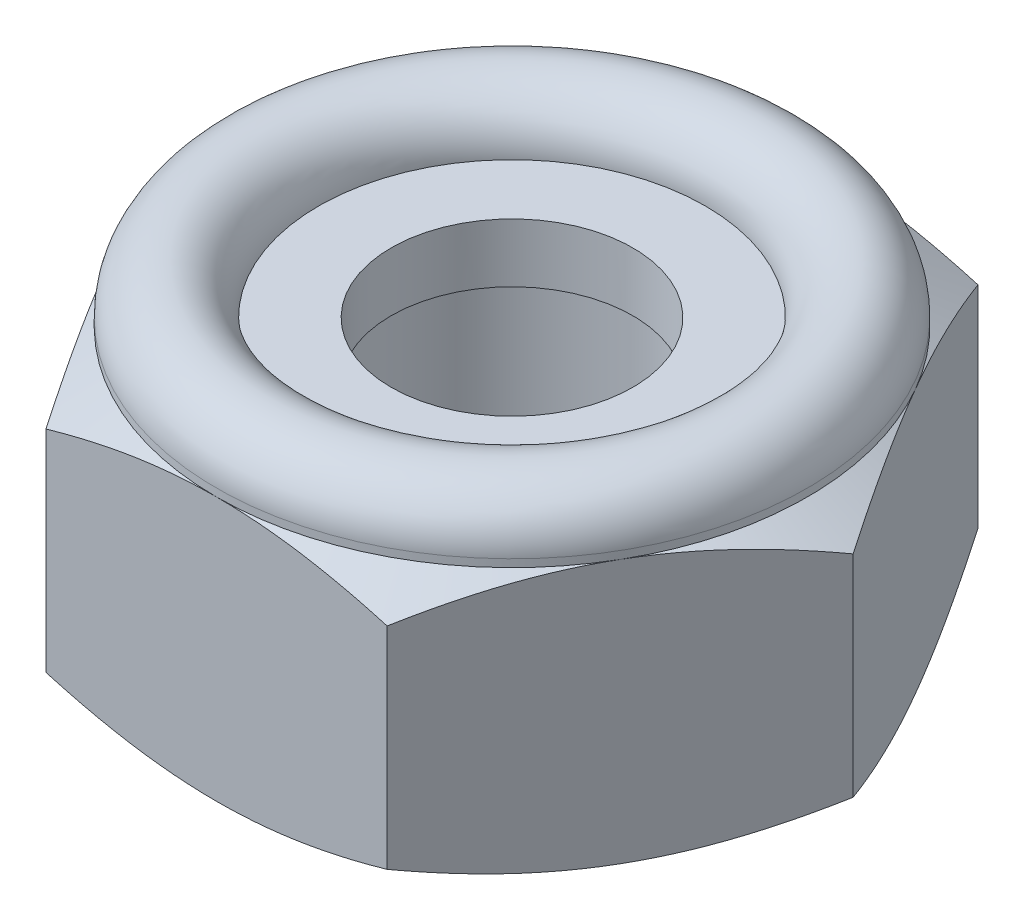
ISO-10303-21;
HEADER;
FILE_DESCRIPTION(('STEP AP214'),'2;1');
FILE_NAME('part.step','',(''),(''),'','','');
FILE_SCHEMA(('AUTOMOTIVE_DESIGN { 1 0 10303 214 1 1 1 1 }'));
ENDSEC;
DATA;
#1=APPLICATION_CONTEXT('core data for automotive mechanical design processes');
#2=APPLICATION_PROTOCOL_DEFINITION('international standard','automotive_design',2000,#1);
#3=PRODUCT_CONTEXT('',#1,'mechanical');
#4=PRODUCT('Part','Part','',(#3));
#5=PRODUCT_RELATED_PRODUCT_CATEGORY('part','',(#4));
#6=PRODUCT_DEFINITION_FORMATION('','',#4);
#7=PRODUCT_DEFINITION_CONTEXT('part definition',#1,'design');
#8=PRODUCT_DEFINITION('design','',#6,#7);
#9=PRODUCT_DEFINITION_SHAPE('','',#8);
#10=(LENGTH_UNIT() NAMED_UNIT(*) SI_UNIT(.MILLI.,.METRE.));
#11=(NAMED_UNIT(*) PLANE_ANGLE_UNIT() SI_UNIT($,.RADIAN.));
#12=(NAMED_UNIT(*) SI_UNIT($,.STERADIAN.) SOLID_ANGLE_UNIT());
#13=UNCERTAINTY_MEASURE_WITH_UNIT(LENGTH_MEASURE(1.E-05),#10,'distance_accuracy_value','');
#14=(GEOMETRIC_REPRESENTATION_CONTEXT(3) GLOBAL_UNCERTAINTY_ASSIGNED_CONTEXT((#13)) GLOBAL_UNIT_ASSIGNED_CONTEXT((#10,
#11,#12)) REPRESENTATION_CONTEXT('',''));
#15=CARTESIAN_POINT('',(0.,0.,0.));
#16=DIRECTION('',(0.,0.,1.));
#17=DIRECTION('',(1.,0.,0.));
#18=AXIS2_PLACEMENT_3D('',#15,#16,#17);
#19=CARTESIAN_POINT('',(0.,5.05,0.));
#20=DIRECTION('',(0.,-1.,0.));
#21=DIRECTION('',(0.,0.,-1.));
#22=AXIS2_PLACEMENT_3D('',#19,#20,#21);
#23=TOROIDAL_SURFACE('',#22,4.55,0.95);
#24=CARTESIAN_POINT('',(0.,5.05,0.));
#25=DIRECTION('',(0.,-1.,0.));
#26=DIRECTION('',(0.,0.,-1.));
#27=AXIS2_PLACEMENT_3D('',#24,#25,#26);
#28=CIRCLE('',#27,5.5);
#29=CARTESIAN_POINT('',(0.,5.05,-5.5));
#30=VERTEX_POINT('',#29);
#31=EDGE_CURVE('E180',#30,#30,#28,.T.);
#32=ORIENTED_EDGE('',*,*,#31,.F.);
#33=EDGE_LOOP('',(#32));
#34=FACE_BOUND('',#33,.T.);
#35=CARTESIAN_POINT('',(0.,5.05,0.));
#36=DIRECTION('',(0.,-1.,0.));
#37=DIRECTION('',(0.,0.,-1.));
#38=AXIS2_PLACEMENT_3D('',#35,#36,#37);
#39=CIRCLE('',#38,3.6);
#40=CARTESIAN_POINT('',(0.,5.05,-3.6));
#41=VERTEX_POINT('',#40);
#42=EDGE_CURVE('E20',#41,#41,#39,.T.);
#43=ORIENTED_EDGE('',*,*,#42,.T.);
#44=EDGE_LOOP('',(#43));
#45=FACE_BOUND('',#44,.T.);
#46=ADVANCED_FACE('F16',(#34,#45),#23,.T.);
#47=CARTESIAN_POINT('',(4.55,5.05,0.));
#48=DIRECTION('',(0.,-1.,0.));
#49=DIRECTION('',(0.,0.,-1.));
#50=AXIS2_PLACEMENT_3D('',#47,#48,#49);
#51=PLANE('',#50);
#52=CARTESIAN_POINT('',(0.,5.05,0.));
#53=DIRECTION('',(0.,1.,0.));
#54=DIRECTION('',(0.,0.,1.));
#55=AXIS2_PLACEMENT_3D('',#52,#53,#54);
#56=CIRCLE('',#55,2.25);
#57=CARTESIAN_POINT('',(0.,5.05,2.25));
#58=VERTEX_POINT('',#57);
#59=EDGE_CURVE('E177',#58,#58,#56,.F.);
#60=ORIENTED_EDGE('',*,*,#59,.T.);
#61=EDGE_LOOP('',(#60));
#62=FACE_BOUND('',#61,.T.);
#63=ORIENTED_EDGE('',*,*,#42,.F.);
#64=EDGE_LOOP('',(#63));
#65=FACE_BOUND('',#64,.T.);
#66=ADVANCED_FACE('F259',(#62,#65),#51,.F.);
#67=CARTESIAN_POINT('',(0.,0.,0.));
#68=DIRECTION('',(0.,-1.,0.));
#69=DIRECTION('',(0.,0.,-1.));
#70=AXIS2_PLACEMENT_3D('',#67,#68,#69);
#71=CYLINDRICAL_SURFACE('',#70,5.5);
#72=CARTESIAN_POINT('',(0.,4.90705642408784,0.));
#73=DIRECTION('',(0.,-1.,0.));
#74=DIRECTION('',(0.,0.,-1.));
#75=AXIS2_PLACEMENT_3D('',#72,#73,#74);
#76=CIRCLE('',#75,5.49999999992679);
#77=CARTESIAN_POINT('',(0.,4.90705642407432,5.49999999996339));
#78=VERTEX_POINT('',#77);
#79=CARTESIAN_POINT('',(-4.76313972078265,4.90705642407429,2.7499999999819));
#80=VERTEX_POINT('',#79);
#81=EDGE_CURVE('E173',#78,#80,#76,.T.);
#82=ORIENTED_EDGE('',*,*,#81,.F.);
#83=CARTESIAN_POINT('',(0.,4.90705642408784,0.));
#84=DIRECTION('',(0.,-1.,0.));
#85=DIRECTION('',(0.,0.,-1.));
#86=AXIS2_PLACEMENT_3D('',#83,#84,#85);
#87=CIRCLE('',#86,5.49999999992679);
#88=CARTESIAN_POINT('',(4.76313972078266,4.90705642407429,2.7499999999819));
#89=VERTEX_POINT('',#88);
#90=EDGE_CURVE('E110',#89,#78,#87,.T.);
#91=ORIENTED_EDGE('',*,*,#90,.F.);
#92=CARTESIAN_POINT('',(0.,4.90705642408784,0.));
#93=DIRECTION('',(0.,-1.,0.));
#94=DIRECTION('',(0.,0.,-1.));
#95=AXIS2_PLACEMENT_3D('',#92,#93,#94);
#96=CIRCLE('',#95,5.49999999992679);
#97=CARTESIAN_POINT('',(4.76313972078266,4.90705642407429,-2.7499999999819));
#98=VERTEX_POINT('',#97);
#99=EDGE_CURVE('E165',#98,#89,#96,.T.);
#100=ORIENTED_EDGE('',*,*,#99,.F.);
#101=CARTESIAN_POINT('',(0.,4.90705642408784,0.));
#102=DIRECTION('',(0.,-1.,0.));
#103=DIRECTION('',(0.,0.,-1.));
#104=AXIS2_PLACEMENT_3D('',#101,#102,#103);
#105=CIRCLE('',#104,5.49999999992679);
#106=CARTESIAN_POINT('',(0.,4.90705642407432,-5.49999999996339));
#107=VERTEX_POINT('',#106);
#108=EDGE_CURVE('E162',#107,#98,#105,.T.);
#109=ORIENTED_EDGE('',*,*,#108,.F.);
#110=CARTESIAN_POINT('',(0.,4.90705642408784,0.));
#111=DIRECTION('',(0.,-1.,0.));
#112=DIRECTION('',(0.,0.,-1.));
#113=AXIS2_PLACEMENT_3D('',#110,#111,#112);
#114=CIRCLE('',#113,5.49999999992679);
#115=CARTESIAN_POINT('',(-4.76313972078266,4.90705642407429,-2.7499999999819));
#116=VERTEX_POINT('',#115);
#117=EDGE_CURVE('E167',#116,#107,#114,.T.);
#118=ORIENTED_EDGE('',*,*,#117,.F.);
#119=CARTESIAN_POINT('',(0.,4.90705642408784,0.));
#120=DIRECTION('',(0.,-1.,0.));
#121=DIRECTION('',(0.,0.,-1.));
#122=AXIS2_PLACEMENT_3D('',#119,#120,#121);
#123=CIRCLE('',#122,5.49999999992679);
#124=EDGE_CURVE('E170',#80,#116,#123,.T.);
#125=ORIENTED_EDGE('',*,*,#124,.F.);
#126=EDGE_LOOP('',(#82,#91,#100,#109,#118,#125));
#127=FACE_BOUND('',#126,.T.);
#128=ORIENTED_EDGE('',*,*,#31,.T.);
#129=EDGE_LOOP('',(#128));
#130=FACE_BOUND('',#129,.T.);
#131=ADVANCED_FACE('F250',(#127,#130),#71,.T.);
#132=CARTESIAN_POINT('',(0.,9.913170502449,0.));
#133=DIRECTION('',(0.,1.,0.));
#134=DIRECTION('',(0.,0.,1.));
#135=AXIS2_PLACEMENT_3D('',#132,#133,#134);
#136=CYLINDRICAL_SURFACE('',#135,2.25);
#137=ORIENTED_EDGE('',*,*,#59,.F.);
#138=EDGE_LOOP('',(#137));
#139=FACE_BOUND('',#138,.T.);
#140=CARTESIAN_POINT('',(0.,3.95591825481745,0.));
#141=DIRECTION('',(0.,1.,0.));
#142=DIRECTION('',(-1.,0.,0.));
#143=AXIS2_PLACEMENT_3D('',#140,#141,#142);
#144=CIRCLE('',#143,2.25000000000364);
#145=CARTESIAN_POINT('',(-2.25000000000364,3.95591825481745,0.));
#146=VERTEX_POINT('',#145);
#147=EDGE_CURVE('E123',#146,#146,#144,.T.);
#148=ORIENTED_EDGE('',*,*,#147,.F.);
#149=EDGE_LOOP('',(#148));
#150=FACE_BOUND('',#149,.T.);
#151=ADVANCED_FACE('F248',(#139,#150),#136,.F.);
#152=CARTESIAN_POINT('',(0.,4.412868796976,0.));
#153=DIRECTION('',(0.,-1.,0.));
#154=DIRECTION('',(0.,0.,-1.));
#155=AXIS2_PLACEMENT_3D('',#152,#153,#154);
#156=CONICAL_SURFACE('',#155,6.35595807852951,1.04719755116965);
#157=ORIENTED_EDGE('',*,*,#90,.T.);
#158=CARTESIAN_POINT('',(0.,4.90705642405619,5.49999999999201));
#159=CARTESIAN_POINT('',(0.134779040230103,4.9070789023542,5.49999999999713));
#160=CARTESIAN_POINT('',(0.269551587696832,4.90419665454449,5.49999999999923));
#161=CARTESIAN_POINT('',(0.538832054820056,4.89278977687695,5.50000000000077));
#162=CARTESIAN_POINT('',(0.673340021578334,4.88426626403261,5.50000000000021));
#163=CARTESIAN_POINT('',(0.941222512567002,4.86180005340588,5.49999999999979));
#164=CARTESIAN_POINT('',(1.07459934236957,4.84788463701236,5.49999999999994));
#165=CARTESIAN_POINT('',(1.34071754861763,4.81493394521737,5.50000000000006));
#166=CARTESIAN_POINT('',(1.47345890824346,4.79589853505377,5.50000000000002));
#167=CARTESIAN_POINT('',(1.8701795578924,4.73170036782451,5.49999999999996));
#168=CARTESIAN_POINT('',(2.13300635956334,4.67941450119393,5.49999999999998));
#169=CARTESIAN_POINT('',(2.65639976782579,4.55882991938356,5.50000000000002));
#170=CARTESIAN_POINT('',(2.91694811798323,4.49045123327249,5.50000000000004));
#171=CARTESIAN_POINT('',(3.17542648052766,4.41581623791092,5.5));
#172=B_SPLINE_CURVE_WITH_KNOTS('',3,(#158,#159,#160,#161,#162,#163,#164,#165,#166,#167,#168,
#169,#170,#171),.UNSPECIFIED.,.F.,.F.,(4,2,2,2,2,2,4),(0.,0.404295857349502,0.808511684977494,
1.21070846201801,1.61291582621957,2.41627637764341,3.22371670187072),.UNSPECIFIED.);
#173=CARTESIAN_POINT('',(3.17542648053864,4.41581623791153,5.49999999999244));
#174=VERTEX_POINT('',#173);
#175=EDGE_CURVE('E104',#78,#174,#172,.T.);
#176=ORIENTED_EDGE('',*,*,#175,.T.);
#177=CARTESIAN_POINT('',(3.17542648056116,4.41581623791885,5.49999999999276));
#178=CARTESIAN_POINT('',(3.30466566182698,4.49045123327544,5.27615117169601));
#179=CARTESIAN_POINT('',(3.43493983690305,4.55882991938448,5.0505096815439));
#180=CARTESIAN_POINT('',(3.69663654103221,4.67941450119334,4.59723769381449));
#181=CARTESIAN_POINT('',(3.82804994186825,4.73170036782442,4.36962300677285));
#182=CARTESIAN_POINT('',(4.02641026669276,4.79589853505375,4.02605284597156));
#183=CARTESIAN_POINT('',(4.09278094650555,4.81493394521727,3.91109545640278));
#184=CARTESIAN_POINT('',(4.22584004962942,4.84788463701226,3.68063032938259));
#185=CARTESIAN_POINT('',(4.29252846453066,4.86180005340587,3.56512260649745));
#186=CARTESIAN_POINT('',(4.42646971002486,4.88426626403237,3.33312956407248));
#187=CARTESIAN_POINT('',(4.4937236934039,4.89278977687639,3.21664224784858));
#188=CARTESIAN_POINT('',(4.62836392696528,4.90419665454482,2.98343852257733));
#189=CARTESIAN_POINT('',(4.69575020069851,4.90707890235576,2.86672207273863));
#190=CARTESIAN_POINT('',(4.76313972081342,4.90705642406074,2.75000000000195));
#191=B_SPLINE_CURVE_WITH_KNOTS('',3,(#177,#178,#179,#180,#181,#182,#183,#184,#185,#186,#187,
#188,#189,#190),.UNSPECIFIED.,.F.,.F.,(4,2,2,2,2,2,4),(0.,0.80744032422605,1.61080087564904,
2.01300823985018,2.41520501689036,2.81942084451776,3.22371670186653),.UNSPECIFIED.);
#192=EDGE_CURVE('E107',#174,#89,#191,.T.);
#193=ORIENTED_EDGE('',*,*,#192,.T.);
#194=EDGE_LOOP('',(#157,#176,#193));
#195=FACE_BOUND('',#194,.T.);
#196=ADVANCED_FACE('F106',(#195),#156,.T.);
#197=CARTESIAN_POINT('',(0.,4.412868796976,0.));
#198=DIRECTION('',(0.,-1.,0.));
#199=DIRECTION('',(0.,0.,-1.));
#200=AXIS2_PLACEMENT_3D('',#197,#198,#199);
#201=CONICAL_SURFACE('',#200,6.35595807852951,1.04719755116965);
#202=ORIENTED_EDGE('',*,*,#81,.T.);
#203=CARTESIAN_POINT('',(-4.76313972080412,4.90705642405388,2.7499999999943));
#204=CARTESIAN_POINT('',(-4.69575020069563,4.90707890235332,2.8667220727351));
#205=CARTESIAN_POINT('',(-4.62836392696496,4.9041966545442,2.98343852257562));
#206=CARTESIAN_POINT('',(-4.4937236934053,4.89278977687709,3.21664224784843));
#207=CARTESIAN_POINT('',(-4.42646971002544,4.88426626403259,3.33312956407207));
#208=CARTESIAN_POINT('',(-4.29252846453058,4.86180005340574,3.56512260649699));
#209=CARTESIAN_POINT('',(-4.22584004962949,4.84788463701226,3.68063032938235));
#210=CARTESIAN_POINT('',(-4.09278094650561,4.8149339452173,3.91109545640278));
#211=CARTESIAN_POINT('',(-4.02641026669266,4.79589853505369,4.02605284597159));
#212=CARTESIAN_POINT('',(-3.82804994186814,4.73170036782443,4.36962300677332));
#213=CARTESIAN_POINT('',(-3.69663654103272,4.67941450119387,4.59723769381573));
#214=CARTESIAN_POINT('',(-3.4349398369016,4.55882991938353,5.05050968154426));
#215=CARTESIAN_POINT('',(-3.30466566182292,4.49045123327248,5.2761511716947));
#216=CARTESIAN_POINT('',(-3.17542648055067,4.41581623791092,5.49999999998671));
#217=B_SPLINE_CURVE_WITH_KNOTS('',3,(#203,#204,#205,#206,#207,#208,#209,#210,#211,#212,#213,
#214,#215,#216),.UNSPECIFIED.,.F.,.F.,(4,2,2,2,2,2,4),(0.,0.404295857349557,0.808511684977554,
1.21070846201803,1.61291582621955,2.41627637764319,3.22371670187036),.UNSPECIFIED.);
#218=CARTESIAN_POINT('',(-3.17542648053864,4.41581623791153,5.49999999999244));
#219=VERTEX_POINT('',#218);
#220=EDGE_CURVE('E132',#80,#219,#217,.T.);
#221=ORIENTED_EDGE('',*,*,#220,.T.);
#222=CARTESIAN_POINT('',(-3.17542648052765,4.41581623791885,5.50000000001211));
#223=CARTESIAN_POINT('',(-2.91694811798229,4.49045123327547,5.50000000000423));
#224=CARTESIAN_POINT('',(-2.65639976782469,4.55882991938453,5.5000000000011));
#225=CARTESIAN_POINT('',(-2.13300635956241,4.67941450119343,5.4999999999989));
#226=CARTESIAN_POINT('',(-1.87017955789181,4.73170036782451,5.4999999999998));
#227=CARTESIAN_POINT('',(-1.47345890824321,4.79589853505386,5.5000000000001));
#228=CARTESIAN_POINT('',(-1.34071754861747,4.81493394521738,5.50000000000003));
#229=CARTESIAN_POINT('',(-1.07459934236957,4.84788463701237,5.49999999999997));
#230=CARTESIAN_POINT('',(-0.941222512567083,4.86180005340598,5.49999999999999));
#231=CARTESIAN_POINT('',(-0.673340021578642,4.88426626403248,5.50000000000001));
#232=CARTESIAN_POINT('',(-0.538832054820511,4.89278977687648,5.5));
#233=CARTESIAN_POINT('',(-0.269551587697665,4.9041966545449,5.5));
#234=CARTESIAN_POINT('',(-0.134779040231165,4.90707890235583,5.49999999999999));
#235=CARTESIAN_POINT('',(-1.3310176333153E-12,4.9070564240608,5.5));
#236=B_SPLINE_CURVE_WITH_KNOTS('',3,(#222,#223,#224,#225,#226,#227,#228,#229,#230,#231,#232,
#233,#234,#235),.UNSPECIFIED.,.F.,.F.,(4,2,2,2,2,2,4),(0.,0.807440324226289,1.61080087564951,
2.01300823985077,2.41520501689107,2.8194208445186,3.22371670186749),.UNSPECIFIED.);
#237=EDGE_CURVE('E115',#219,#78,#236,.T.);
#238=ORIENTED_EDGE('',*,*,#237,.T.);
#239=EDGE_LOOP('',(#202,#221,#238));
#240=FACE_BOUND('',#239,.T.);
#241=ADVANCED_FACE('F257',(#240),#201,.T.);
#242=CARTESIAN_POINT('',(0.,4.412868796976,0.));
#243=DIRECTION('',(0.,-1.,0.));
#244=DIRECTION('',(0.,0.,-1.));
#245=AXIS2_PLACEMENT_3D('',#242,#243,#244);
#246=CONICAL_SURFACE('',#245,6.35595807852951,1.04719755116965);
#247=ORIENTED_EDGE('',*,*,#124,.T.);
#248=CARTESIAN_POINT('',(-4.76313972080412,4.90705642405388,-2.7499999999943));
#249=CARTESIAN_POINT('',(-4.8305292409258,4.90707890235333,-2.63327792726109));
#250=CARTESIAN_POINT('',(-4.8979155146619,4.90419665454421,-2.51656147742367));
#251=CARTESIAN_POINT('',(-5.03255574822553,4.8927897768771,-2.2833577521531));
#252=CARTESIAN_POINT('',(-5.09980973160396,4.8842662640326,-2.16687043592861));
#253=CARTESIAN_POINT('',(-5.23375097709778,4.86180005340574,-1.93487739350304));
#254=CARTESIAN_POINT('',(-5.30043939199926,4.84788463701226,-1.81936967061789));
#255=CARTESIAN_POINT('',(-5.43349849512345,4.8149339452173,-1.58890454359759));
#256=CARTESIAN_POINT('',(-5.49986917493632,4.79589853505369,-1.47394715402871));
#257=CARTESIAN_POINT('',(-5.69822949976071,4.73170036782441,-1.13037699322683));
#258=CARTESIAN_POINT('',(-5.8296429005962,4.67941450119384,-0.902762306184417));
#259=CARTESIAN_POINT('',(-6.09133960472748,4.55882991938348,-0.449490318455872));
#260=CARTESIAN_POINT('',(-6.22161377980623,4.49045123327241,-0.223848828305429));
#261=CARTESIAN_POINT('',(-6.35085296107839,4.41581623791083,-1.33229746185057E-11));
#262=B_SPLINE_CURVE_WITH_KNOTS('',3,(#248,#249,#250,#251,#252,#253,#254,#255,#256,#257,#258,
#259,#260,#261),.UNSPECIFIED.,.F.,.F.,(4,2,2,2,2,2,4),(0.,0.404295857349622,0.808511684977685,
1.21070846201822,1.61291582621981,2.41627637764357,3.22371670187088),.UNSPECIFIED.);
#263=CARTESIAN_POINT('',(-6.35085296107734,4.41581623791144,0.));
#264=VERTEX_POINT('',#263);
#265=EDGE_CURVE('E143',#116,#264,#262,.T.);
#266=ORIENTED_EDGE('',*,*,#265,.T.);
#267=CARTESIAN_POINT('',(-6.35085296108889,4.41581623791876,1.93703885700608E-11));
#268=CARTESIAN_POINT('',(-6.22161377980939,4.49045123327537,0.223848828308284));
#269=CARTESIAN_POINT('',(-6.0913396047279,4.55882991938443,0.4494903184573));
#270=CARTESIAN_POINT('',(-5.82964290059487,4.67941450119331,0.902762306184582));
#271=CARTESIAN_POINT('',(-5.69822949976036,4.7317003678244,1.13037699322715));
#272=CARTESIAN_POINT('',(-5.49986917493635,4.79589853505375,1.4739471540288));
#273=CARTESIAN_POINT('',(-5.43349849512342,4.81493394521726,1.58890454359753));
#274=CARTESIAN_POINT('',(-5.30043939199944,4.84788463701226,1.8193696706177));
#275=CARTESIAN_POINT('',(-5.23375097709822,4.86180005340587,1.93487739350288));
#276=CARTESIAN_POINT('',(-5.09980973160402,4.88426626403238,2.1668704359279));
#277=CARTESIAN_POINT('',(-5.03255574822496,4.89278977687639,2.28335775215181));
#278=CARTESIAN_POINT('',(-4.89791551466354,4.90419665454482,2.5165614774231));
#279=CARTESIAN_POINT('',(-4.8305292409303,4.90707890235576,2.63327792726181));
#280=CARTESIAN_POINT('',(-4.76313972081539,4.90705642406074,2.74999999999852));
#281=B_SPLINE_CURVE_WITH_KNOTS('',3,(#267,#268,#269,#270,#271,#272,#273,#274,#275,#276,#277,
#278,#279,#280),.UNSPECIFIED.,.F.,.F.,(4,2,2,2,2,2,4),(0.,0.807440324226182,1.6108008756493,
2.01300823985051,2.41520501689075,2.81942084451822,3.22371670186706),.UNSPECIFIED.);
#282=EDGE_CURVE('E129',#264,#80,#281,.T.);
#283=ORIENTED_EDGE('',*,*,#282,.T.);
#284=EDGE_LOOP('',(#247,#266,#283));
#285=FACE_BOUND('',#284,.T.);
#286=ADVANCED_FACE('F370',(#285),#246,.T.);
#287=CARTESIAN_POINT('',(0.,4.412868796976,0.));
#288=DIRECTION('',(0.,-1.,0.));
#289=DIRECTION('',(0.,0.,-1.));
#290=AXIS2_PLACEMENT_3D('',#287,#288,#289);
#291=CONICAL_SURFACE('',#290,6.35595807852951,1.04719755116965);
#292=CARTESIAN_POINT('',(0.,4.90705642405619,-5.49999999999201));
#293=CARTESIAN_POINT('',(-0.134779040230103,4.9070789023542,-5.49999999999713));
#294=CARTESIAN_POINT('',(-0.269551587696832,4.90419665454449,-5.49999999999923));
#295=CARTESIAN_POINT('',(-0.538832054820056,4.89278977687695,-5.50000000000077));
#296=CARTESIAN_POINT('',(-0.673340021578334,4.88426626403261,-5.50000000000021));
#297=CARTESIAN_POINT('',(-0.941222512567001,4.86180005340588,-5.49999999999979));
#298=CARTESIAN_POINT('',(-1.07459934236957,4.84788463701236,-5.49999999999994));
#299=CARTESIAN_POINT('',(-1.34071754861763,4.81493394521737,-5.50000000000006));
#300=CARTESIAN_POINT('',(-1.47345890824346,4.79589853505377,-5.50000000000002));
#301=CARTESIAN_POINT('',(-1.8701795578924,4.73170036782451,-5.49999999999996));
#302=CARTESIAN_POINT('',(-2.13300635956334,4.67941450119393,-5.49999999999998));
#303=CARTESIAN_POINT('',(-2.65639976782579,4.55882991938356,-5.50000000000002));
#304=CARTESIAN_POINT('',(-2.91694811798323,4.49045123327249,-5.50000000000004));
#305=CARTESIAN_POINT('',(-3.17542648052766,4.41581623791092,-5.5));
#306=B_SPLINE_CURVE_WITH_KNOTS('',3,(#292,#293,#294,#295,#296,#297,#298,#299,#300,#301,#302,
#303,#304,#305),.UNSPECIFIED.,.F.,.F.,(4,2,2,2,2,2,4),(0.,0.404295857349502,0.808511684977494,
1.21070846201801,1.61291582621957,2.41627637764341,3.22371670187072),.UNSPECIFIED.);
#307=CARTESIAN_POINT('',(-3.17542648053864,4.41581623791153,-5.49999999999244));
#308=VERTEX_POINT('',#307);
#309=EDGE_CURVE('E147',#107,#308,#306,.T.);
#310=ORIENTED_EDGE('',*,*,#309,.T.);
#311=CARTESIAN_POINT('',(-3.17542648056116,4.41581623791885,-5.49999999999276));
#312=CARTESIAN_POINT('',(-3.30466566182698,4.49045123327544,-5.27615117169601));
#313=CARTESIAN_POINT('',(-3.43493983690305,4.55882991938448,-5.0505096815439));
#314=CARTESIAN_POINT('',(-3.69663654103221,4.67941450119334,-4.59723769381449));
#315=CARTESIAN_POINT('',(-3.82804994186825,4.73170036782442,-4.36962300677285));
#316=CARTESIAN_POINT('',(-4.02641026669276,4.79589853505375,-4.02605284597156));
#317=CARTESIAN_POINT('',(-4.09278094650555,4.81493394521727,-3.91109545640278));
#318=CARTESIAN_POINT('',(-4.22584004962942,4.84788463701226,-3.68063032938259));
#319=CARTESIAN_POINT('',(-4.29252846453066,4.86180005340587,-3.56512260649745));
#320=CARTESIAN_POINT('',(-4.42646971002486,4.88426626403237,-3.33312956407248));
#321=CARTESIAN_POINT('',(-4.4937236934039,4.89278977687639,-3.21664224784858));
#322=CARTESIAN_POINT('',(-4.62836392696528,4.90419665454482,-2.98343852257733));
#323=CARTESIAN_POINT('',(-4.69575020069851,4.90707890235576,-2.86672207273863));
#324=CARTESIAN_POINT('',(-4.76313972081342,4.90705642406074,-2.75000000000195));
#325=B_SPLINE_CURVE_WITH_KNOTS('',3,(#311,#312,#313,#314,#315,#316,#317,#318,#319,#320,#321,
#322,#323,#324),.UNSPECIFIED.,.F.,.F.,(4,2,2,2,2,2,4),(0.,0.80744032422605,1.61080087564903,
2.01300823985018,2.41520501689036,2.81942084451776,3.22371670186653),.UNSPECIFIED.);
#326=EDGE_CURVE('E139',#308,#116,#325,.T.);
#327=ORIENTED_EDGE('',*,*,#326,.T.);
#328=ORIENTED_EDGE('',*,*,#117,.T.);
#329=EDGE_LOOP('',(#310,#327,#328));
#330=FACE_BOUND('',#329,.T.);
#331=ADVANCED_FACE('F373',(#330),#291,.T.);
#332=CARTESIAN_POINT('',(0.,4.412868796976,0.));
#333=DIRECTION('',(0.,-1.,0.));
#334=DIRECTION('',(0.,0.,-1.));
#335=AXIS2_PLACEMENT_3D('',#332,#333,#334);
#336=CONICAL_SURFACE('',#335,6.35595807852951,1.04719755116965);
#337=CARTESIAN_POINT('',(4.76313972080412,4.90705642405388,2.7499999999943));
#338=CARTESIAN_POINT('',(4.8305292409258,4.90707890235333,2.63327792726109));
#339=CARTESIAN_POINT('',(4.8979155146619,4.90419665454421,2.51656147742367));
#340=CARTESIAN_POINT('',(5.03255574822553,4.8927897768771,2.2833577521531));
#341=CARTESIAN_POINT('',(5.09980973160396,4.8842662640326,2.16687043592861));
#342=CARTESIAN_POINT('',(5.23375097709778,4.86180005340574,1.93487739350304));
#343=CARTESIAN_POINT('',(5.30043939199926,4.84788463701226,1.81936967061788));
#344=CARTESIAN_POINT('',(5.43349849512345,4.8149339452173,1.58890454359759));
#345=CARTESIAN_POINT('',(5.49986917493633,4.79589853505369,1.4739471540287));
#346=CARTESIAN_POINT('',(5.69822949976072,4.73170036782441,1.13037699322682));
#347=CARTESIAN_POINT('',(5.82964290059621,4.67941450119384,0.90276230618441));
#348=CARTESIAN_POINT('',(6.09133960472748,4.55882991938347,0.449490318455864));
#349=CARTESIAN_POINT('',(6.22161377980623,4.49045123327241,0.223848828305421));
#350=CARTESIAN_POINT('',(6.3508529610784,4.41581623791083,1.33143010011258E-11));
#351=B_SPLINE_CURVE_WITH_KNOTS('',3,(#337,#338,#339,#340,#341,#342,#343,#344,#345,#346,#347,
#348,#349,#350),.UNSPECIFIED.,.F.,.F.,(4,2,2,2,2,2,4),(0.,0.404295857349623,0.808511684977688,
1.21070846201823,1.61291582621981,2.41627637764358,3.22371670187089),.UNSPECIFIED.);
#352=CARTESIAN_POINT('',(6.3508529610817,4.41581623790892,7.55421257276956E-12));
#353=VERTEX_POINT('',#352);
#354=EDGE_CURVE('E122',#89,#353,#351,.T.);
#355=ORIENTED_EDGE('',*,*,#354,.T.);
#356=CARTESIAN_POINT('',(6.35085296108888,4.41581623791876,-1.93812426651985E-11));
#357=CARTESIAN_POINT('',(6.22161377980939,4.49045123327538,-0.223848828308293));
#358=CARTESIAN_POINT('',(6.09133960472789,4.55882991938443,-0.449490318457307));
#359=CARTESIAN_POINT('',(5.82964290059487,4.67941450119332,-0.902762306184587));
#360=CARTESIAN_POINT('',(5.69822949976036,4.7317003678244,-1.13037699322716));
#361=CARTESIAN_POINT('',(5.49986917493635,4.79589853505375,-1.47394715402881));
#362=CARTESIAN_POINT('',(5.43349849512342,4.81493394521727,-1.58890454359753));
#363=CARTESIAN_POINT('',(5.30043939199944,4.84788463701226,-1.8193696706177));
#364=CARTESIAN_POINT('',(5.23375097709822,4.86180005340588,-1.93487739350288));
#365=CARTESIAN_POINT('',(5.09980973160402,4.88426626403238,-2.1668704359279));
#366=CARTESIAN_POINT('',(5.03255574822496,4.89278977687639,-2.28335775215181));
#367=CARTESIAN_POINT('',(4.89791551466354,4.90419665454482,-2.5165614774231));
#368=CARTESIAN_POINT('',(4.8305292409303,4.90707890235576,-2.63327792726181));
#369=CARTESIAN_POINT('',(4.7631397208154,4.90705642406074,-2.74999999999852));
#370=B_SPLINE_CURVE_WITH_KNOTS('',3,(#356,#357,#358,#359,#360,#361,#362,#363,#364,#365,#366,
#367,#368,#369),.UNSPECIFIED.,.F.,.F.,(4,2,2,2,2,2,4),(0.,0.807440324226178,1.61080087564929,
2.0130082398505,2.41520501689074,2.81942084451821,3.22371670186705),.UNSPECIFIED.);
#371=EDGE_CURVE('E153',#353,#98,#370,.T.);
#372=ORIENTED_EDGE('',*,*,#371,.T.);
#373=ORIENTED_EDGE('',*,*,#99,.T.);
#374=EDGE_LOOP('',(#355,#372,#373));
#375=FACE_BOUND('',#374,.T.);
#376=ADVANCED_FACE('F393',(#375),#336,.T.);
#377=CARTESIAN_POINT('',(0.,4.412868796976,0.));
#378=DIRECTION('',(0.,-1.,0.));
#379=DIRECTION('',(0.,0.,-1.));
#380=AXIS2_PLACEMENT_3D('',#377,#378,#379);
#381=CONICAL_SURFACE('',#380,6.35595807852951,1.04719755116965);
#382=CARTESIAN_POINT('',(4.76313972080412,4.90705642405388,-2.7499999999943));
#383=CARTESIAN_POINT('',(4.69575020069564,4.90707890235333,-2.8667220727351));
#384=CARTESIAN_POINT('',(4.62836392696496,4.9041966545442,-2.98343852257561));
#385=CARTESIAN_POINT('',(4.4937236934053,4.89278977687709,-3.21664224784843));
#386=CARTESIAN_POINT('',(4.42646971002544,4.88426626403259,-3.33312956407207));
#387=CARTESIAN_POINT('',(4.29252846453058,4.86180005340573,-3.56512260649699));
#388=CARTESIAN_POINT('',(4.22584004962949,4.84788463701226,-3.68063032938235));
#389=CARTESIAN_POINT('',(4.09278094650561,4.8149339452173,-3.91109545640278));
#390=CARTESIAN_POINT('',(4.02641026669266,4.7958985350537,-4.02605284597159));
#391=CARTESIAN_POINT('',(3.82804994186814,4.73170036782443,-4.36962300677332));
#392=CARTESIAN_POINT('',(3.69663654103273,4.67941450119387,-4.59723769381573));
#393=CARTESIAN_POINT('',(3.4349398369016,4.55882991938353,-5.05050968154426));
#394=CARTESIAN_POINT('',(3.30466566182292,4.49045123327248,-5.2761511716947));
#395=CARTESIAN_POINT('',(3.17542648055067,4.41581623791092,-5.49999999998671));
#396=B_SPLINE_CURVE_WITH_KNOTS('',3,(#382,#383,#384,#385,#386,#387,#388,#389,#390,#391,#392,
#393,#394,#395),.UNSPECIFIED.,.F.,.F.,(4,2,2,2,2,2,4),(0.,0.404295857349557,0.808511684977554,
1.21070846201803,1.61291582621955,2.41627637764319,3.22371670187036),.UNSPECIFIED.);
#397=CARTESIAN_POINT('',(3.17542648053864,4.41581623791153,-5.49999999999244));
#398=VERTEX_POINT('',#397);
#399=EDGE_CURVE('E151',#98,#398,#396,.T.);
#400=ORIENTED_EDGE('',*,*,#399,.T.);
#401=CARTESIAN_POINT('',(3.17542648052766,4.41581623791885,-5.50000000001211));
#402=CARTESIAN_POINT('',(2.9169481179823,4.49045123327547,-5.50000000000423));
#403=CARTESIAN_POINT('',(2.65639976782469,4.55882991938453,-5.5000000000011));
#404=CARTESIAN_POINT('',(2.13300635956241,4.67941450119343,-5.4999999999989));
#405=CARTESIAN_POINT('',(1.87017955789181,4.73170036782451,-5.4999999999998));
#406=CARTESIAN_POINT('',(1.47345890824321,4.79589853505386,-5.5000000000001));
#407=CARTESIAN_POINT('',(1.34071754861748,4.81493394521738,-5.50000000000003));
#408=CARTESIAN_POINT('',(1.07459934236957,4.84788463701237,-5.49999999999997));
#409=CARTESIAN_POINT('',(0.941222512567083,4.86180005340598,-5.49999999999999));
#410=CARTESIAN_POINT('',(0.673340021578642,4.88426626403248,-5.50000000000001));
#411=CARTESIAN_POINT('',(0.538832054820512,4.89278977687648,-5.5));
#412=CARTESIAN_POINT('',(0.269551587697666,4.9041966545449,-5.5));
#413=CARTESIAN_POINT('',(0.134779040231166,4.90707890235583,-5.49999999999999));
#414=CARTESIAN_POINT('',(1.33143776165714E-12,4.9070564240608,-5.5));
#415=B_SPLINE_CURVE_WITH_KNOTS('',3,(#401,#402,#403,#404,#405,#406,#407,#408,#409,#410,#411,
#412,#413,#414),.UNSPECIFIED.,.F.,.F.,(4,2,2,2,2,2,4),(0.,0.80744032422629,1.61080087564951,
2.01300823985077,2.41520501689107,2.8194208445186,3.22371670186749),.UNSPECIFIED.);
#416=EDGE_CURVE('E142',#398,#107,#415,.T.);
#417=ORIENTED_EDGE('',*,*,#416,.T.);
#418=ORIENTED_EDGE('',*,*,#108,.T.);
#419=EDGE_LOOP('',(#400,#417,#418));
#420=FACE_BOUND('',#419,.T.);
#421=ADVANCED_FACE('F244',(#420),#381,.T.);
#422=CARTESIAN_POINT('',(0.,3.99999999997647,0.));
#423=DIRECTION('',(0.,1.,0.));
#424=DIRECTION('',(0.,0.,1.));
#425=AXIS2_PLACEMENT_3D('',#422,#423,#424);
#426=CONICAL_SURFACE('',#425,2.49999999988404,1.3962634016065);
#427=CARTESIAN_POINT('',(0.,4.,0.));
#428=DIRECTION('',(0.,-1.,0.));
#429=DIRECTION('',(0.,0.,-1.));
#430=AXIS2_PLACEMENT_3D('',#427,#428,#429);
#431=CIRCLE('',#430,2.5);
#432=CARTESIAN_POINT('',(0.,4.,-2.5));
#433=VERTEX_POINT('',#432);
#434=EDGE_CURVE('E150',#433,#433,#431,.T.);
#435=ORIENTED_EDGE('',*,*,#434,.T.);
#436=EDGE_LOOP('',(#435));
#437=FACE_BOUND('',#436,.T.);
#438=ORIENTED_EDGE('',*,*,#147,.T.);
#439=EDGE_LOOP('',(#438));
#440=FACE_BOUND('',#439,.T.);
#441=ADVANCED_FACE('F241',(#437,#440),#426,.T.);
#442=CARTESIAN_POINT('',(3.175426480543,6.,5.5));
#443=DIRECTION('',(-0.866025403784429,0.,-0.500000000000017));
#444=DIRECTION('',(-0.500000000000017,0.,0.866025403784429));
#445=AXIS2_PLACEMENT_3D('',#442,#443,#444);
#446=PLANE('',#445);
#447=DIRECTION('',(0.,1.,0.));
#448=VECTOR('',#447,1.);
#449=CARTESIAN_POINT('',(6.35085296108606,6.,0.));
#450=LINE('',#449,#448);
#451=CARTESIAN_POINT('',(6.35085293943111,0.491240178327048,3.75074721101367E-08));
#452=VERTEX_POINT('',#451);
#453=EDGE_CURVE('E146',#452,#353,#450,.T.);
#454=ORIENTED_EDGE('',*,*,#453,.T.);
#455=ORIENTED_EDGE('',*,*,#354,.F.);
#456=ORIENTED_EDGE('',*,*,#192,.F.);
#457=DIRECTION('',(0.,1.,0.));
#458=VECTOR('',#457,1.);
#459=CARTESIAN_POINT('',(3.175426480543,6.,5.5));
#460=LINE('',#459,#458);
#461=CARTESIAN_POINT('',(3.17542649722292,0.491240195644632,5.5));
#462=VERTEX_POINT('',#461);
#463=EDGE_CURVE('E114',#174,#462,#460,.F.);
#464=ORIENTED_EDGE('',*,*,#463,.T.);
#465=CARTESIAN_POINT('',(4.76313972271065,-5.29133824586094E-09,2.75000000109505));
#466=CARTESIAN_POINT('',(4.69575020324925,-2.24827747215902E-05,2.86672206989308));
#467=CARTESIAN_POINT('',(4.62836393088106,0.0028597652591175,2.98343851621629));
#468=CARTESIAN_POINT('',(4.49372370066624,0.0142666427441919,3.21664223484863));
#469=CARTESIAN_POINT('',(4.42646971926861,0.022790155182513,3.33312954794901));
#470=CARTESIAN_POINT('',(4.29252847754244,0.0452563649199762,3.56512258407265));
#471=CARTESIAN_POINT('',(4.22584006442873,0.0591717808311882,3.68063030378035));
#472=CARTESIAN_POINT('',(4.09278096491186,0.0921224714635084,3.91109542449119));
#473=CARTESIAN_POINT('',(4.02641028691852,0.111157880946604,4.02605281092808));
#474=CARTESIAN_POINT('',(3.82804996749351,0.175356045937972,4.36962296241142));
#475=CARTESIAN_POINT('',(3.69663657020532,0.22764191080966,4.59723764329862));
#476=CARTESIAN_POINT('',(3.43493987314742,0.348226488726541,5.0505096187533));
#477=CARTESIAN_POINT('',(3.30466570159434,0.41660517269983,5.27615110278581));
#478=CARTESIAN_POINT('',(3.17542652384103,0.491240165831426,5.49999992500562));
#479=B_SPLINE_CURVE_WITH_KNOTS('',3,(#465,#466,#467,#468,#469,#470,#471,#472,#473,#474,#475,
#476,#477,#478),.UNSPECIFIED.,.F.,.F.,(4,2,2,2,2,2,4),(0.,0.404295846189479,0.80851166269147,
1.21070842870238,1.61291578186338,2.41627631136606,3.22371661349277),.UNSPECIFIED.);
#480=CARTESIAN_POINT('',(4.76313972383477,-2.02206151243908E-09,2.75000000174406));
#481=VERTEX_POINT('',#480);
#482=EDGE_CURVE('E291',#481,#462,#479,.T.);
#483=ORIENTED_EDGE('',*,*,#482,.F.);
#484=CARTESIAN_POINT('',(6.35085291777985,0.491240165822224,7.50163276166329E-08));
#485=CARTESIAN_POINT('',(6.22161374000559,0.416605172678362,0.223848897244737));
#486=CARTESIAN_POINT('',(6.0913395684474,0.348226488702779,0.449490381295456));
#487=CARTESIAN_POINT('',(5.82964287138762,0.22764191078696,0.902762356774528));
#488=CARTESIAN_POINT('',(5.69822947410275,0.175356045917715,1.13037703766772));
#489=CARTESIAN_POINT('',(5.49986915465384,0.111157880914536,1.473947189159));
#490=CARTESIAN_POINT('',(5.43349847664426,0.0921224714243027,1.58890457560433));
#491=CARTESIAN_POINT('',(5.30043937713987,0.0591717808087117,1.81936969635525));
#492=CARTESIAN_POINT('',(5.23375096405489,0.0452563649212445,1.93487741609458));
#493=CARTESIAN_POINT('',(5.09980972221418,0.0227901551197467,2.16687045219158));
#494=CARTESIAN_POINT('',(5.0325557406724,0.0142666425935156,2.28335776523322));
#495=CARTESIAN_POINT('',(4.8979155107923,0.00285976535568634,2.5165614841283));
#496=CARTESIAN_POINT('',(4.83052923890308,-2.24823425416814E-05,2.63327793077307));
#497=CARTESIAN_POINT('',(4.76313972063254,-4.04412333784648E-09,2.75000000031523));
#498=B_SPLINE_CURVE_WITH_KNOTS('',3,(#484,#485,#486,#487,#488,#489,#490,#491,#492,#493,#494,
#495,#496,#497),.UNSPECIFIED.,.F.,.F.,(4,2,2,2,2,2,4),(0.,0.807440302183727,1.61080083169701,
2.01300818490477,2.41520495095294,2.81942076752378,3.22371661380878),.UNSPECIFIED.);
#499=EDGE_CURVE('E161',#452,#481,#498,.T.);
#500=ORIENTED_EDGE('',*,*,#499,.F.);
#501=EDGE_LOOP('',(#454,#455,#456,#464,#483,#500));
#502=FACE_BOUND('',#501,.T.);
#503=ADVANCED_FACE('F120',(#502),#446,.F.);
#504=CARTESIAN_POINT('',(-3.175426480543,6.,5.5));
#505=DIRECTION('',(0.,0.,-1.));
#506=DIRECTION('',(-1.,0.,0.));
#507=AXIS2_PLACEMENT_3D('',#504,#505,#506);
#508=PLANE('',#507);
#509=ORIENTED_EDGE('',*,*,#463,.F.);
#510=ORIENTED_EDGE('',*,*,#175,.F.);
#511=ORIENTED_EDGE('',*,*,#237,.F.);
#512=DIRECTION('',(0.,1.,0.));
#513=VECTOR('',#512,1.);
#514=CARTESIAN_POINT('',(-3.175426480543,6.,5.5));
#515=LINE('',#514,#513);
#516=CARTESIAN_POINT('',(-3.17542647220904,0.491240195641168,5.50000001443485));
#517=VERTEX_POINT('',#516);
#518=EDGE_CURVE('E137',#219,#517,#515,.F.);
#519=ORIENTED_EDGE('',*,*,#518,.T.);
#520=CARTESIAN_POINT('',(0.,-5.29014034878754E-09,5.50000000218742));
#521=CARTESIAN_POINT('',(-0.134779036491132,-2.2482774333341E-05,5.50000000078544));
#522=CARTESIAN_POINT('',(-0.26955158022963,0.00285976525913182,5.50000000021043));
#523=CARTESIAN_POINT('',(-0.538832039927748,0.0142666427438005,5.49999999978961));
#524=CARTESIAN_POINT('',(-0.673340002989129,0.0227901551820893,5.49999999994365));
#525=CARTESIAN_POINT('',(-0.941222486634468,0.0452563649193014,5.50000000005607));
#526=CARTESIAN_POINT('',(-1.07459931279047,0.0591717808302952,5.50000000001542));
#527=CARTESIAN_POINT('',(-1.34071751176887,0.0921224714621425,5.49999999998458));
#528=CARTESIAN_POINT('',(-1.47345886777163,0.111157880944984,5.49999999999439));
#529=CARTESIAN_POINT('',(-1.870179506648,0.175356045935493,5.5000000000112));
#530=CARTESIAN_POINT('',(-2.13300630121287,0.227641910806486,5.50000000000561));
#531=CARTESIAN_POINT('',(-2.65639969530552,0.348226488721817,5.49999999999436));
#532=CARTESIAN_POINT('',(-2.91694803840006,0.416605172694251,5.49999999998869));
#533=CARTESIAN_POINT('',(-3.17542639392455,0.49124016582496,5.5));
#534=B_SPLINE_CURVE_WITH_KNOTS('',3,(#520,#521,#522,#523,#524,#525,#526,#527,#528,#529,#530,
#531,#532,#533),.UNSPECIFIED.,.F.,.F.,(4,2,2,2,2,2,4),(0.,0.404295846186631,0.808511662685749,
1.21070842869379,1.61291578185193,2.41627631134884,3.22371661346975),.UNSPECIFIED.);
#535=CARTESIAN_POINT('',(0.,-2.01361590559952E-09,5.50000000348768));
#536=VERTEX_POINT('',#535);
#537=EDGE_CURVE('E330',#536,#517,#534,.T.);
#538=ORIENTED_EDGE('',*,*,#537,.F.);
#539=CARTESIAN_POINT('',(3.17542651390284,0.49124020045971,5.5));
#540=CARTESIAN_POINT('',(2.91694814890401,0.416605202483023,5.5));
#541=CARTESIAN_POINT('',(2.65639979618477,0.348226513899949,5.5));
#542=CARTESIAN_POINT('',(2.13300638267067,0.227641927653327,5.5));
#543=CARTESIAN_POINT('',(1.8701795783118,0.175356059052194,5.5));
#544=CARTESIAN_POINT('',(1.47345892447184,0.11115788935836,5.5));
#545=CARTESIAN_POINT('',(1.34071756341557,0.0921224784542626,5.5));
#546=CARTESIAN_POINT('',(1.07459935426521,0.0591717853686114,5.5));
#547=CARTESIAN_POINT('',(0.941222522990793,0.0452563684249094,5.5));
#548=CARTESIAN_POINT('',(0.673340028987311,0.0227901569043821,5.5));
#549=CARTESIAN_POINT('',(0.538832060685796,0.0142666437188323,5.5));
#550=CARTESIAN_POINT('',(0.269551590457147,0.00285976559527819,5.5));
#551=CARTESIAN_POINT('',(0.134779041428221,-2.24823290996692E-05,5.5));
#552=CARTESIAN_POINT('',(-3.64571290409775E-10,-4.02723187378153E-09,5.5));
#553=B_SPLINE_CURVE_WITH_KNOTS('',3,(#539,#540,#541,#542,#543,#544,#545,#546,#547,#548,#549,
#550,#551,#552),.UNSPECIFIED.,.F.,.F.,(4,2,2,2,2,2,4),(0.,0.807440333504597,1.61080089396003,
2.013008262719,2.41520504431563,2.8194208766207,3.22371673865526),.UNSPECIFIED.);
#554=EDGE_CURVE('E127',#462,#536,#553,.T.);
#555=ORIENTED_EDGE('',*,*,#554,.F.);
#556=EDGE_LOOP('',(#509,#510,#511,#519,#538,#555));
#557=FACE_BOUND('',#556,.T.);
#558=ADVANCED_FACE('F125',(#557),#508,.F.);
#559=CARTESIAN_POINT('',(-3.175426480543,6.,5.5));
#560=DIRECTION('',(0.866025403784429,0.,-0.500000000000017));
#561=DIRECTION('',(-0.500000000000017,0.,-0.866025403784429));
#562=AXIS2_PLACEMENT_3D('',#559,#560,#561);
#563=PLANE('',#562);
#564=ORIENTED_EDGE('',*,*,#518,.F.);
#565=ORIENTED_EDGE('',*,*,#220,.F.);
#566=ORIENTED_EDGE('',*,*,#282,.F.);
#567=DIRECTION('',(0.,1.,0.));
#568=VECTOR('',#567,1.);
#569=CARTESIAN_POINT('',(-6.35085296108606,6.,0.));
#570=LINE('',#569,#568);
#571=CARTESIAN_POINT('',(-6.35085296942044,0.491240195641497,1.44355349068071E-08));
#572=VERTEX_POINT('',#571);
#573=EDGE_CURVE('E140',#264,#572,#570,.F.);
#574=ORIENTED_EDGE('',*,*,#573,.T.);
#575=CARTESIAN_POINT('',(-4.76313972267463,-5.29001960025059E-09,2.75000000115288));
#576=CARTESIAN_POINT('',(-4.8305292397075,-2.2482775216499E-05,2.63327793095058));
#577=CARTESIAN_POINT('',(-4.89791551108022,0.00285976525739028,2.51656148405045));
#578=CARTESIAN_POINT('',(-5.0325557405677,0.0142666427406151,2.28335776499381));
#579=CARTESIAN_POINT('',(-5.09980972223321,0.0227901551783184,2.16687045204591));
#580=CARTESIAN_POINT('',(-5.23375096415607,0.0452563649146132,1.93487741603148));
#581=CARTESIAN_POINT('',(-5.30043937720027,0.0591717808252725,1.81936969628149));
#582=CARTESIAN_POINT('',(-5.43349847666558,0.0921224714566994,1.58890457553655));
#583=CARTESIAN_POINT('',(-5.49986915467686,0.111157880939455,1.47394718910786));
#584=CARTESIAN_POINT('',(-5.69822947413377,0.175356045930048,1.13037703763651));
#585=CARTESIAN_POINT('',(-5.82964287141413,0.227641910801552,0.902762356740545));
#586=CARTESIAN_POINT('',(-6.0913395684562,0.348226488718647,0.44949038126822));
#587=CARTESIAN_POINT('',(-6.22161374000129,0.416605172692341,0.223848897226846));
#588=CARTESIAN_POINT('',(-6.35085291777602,0.491240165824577,7.50152257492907E-08));
#589=B_SPLINE_CURVE_WITH_KNOTS('',3,(#575,#576,#577,#578,#579,#580,#581,#582,#583,#584,#585,
#586,#587,#588),.UNSPECIFIED.,.F.,.F.,(4,2,2,2,2,2,4),(0.,0.404295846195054,0.80851166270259,
1.2107084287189,1.61291578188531,2.41627631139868,3.22371661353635),.UNSPECIFIED.);
#590=CARTESIAN_POINT('',(-4.76313972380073,-2.01358357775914E-09,2.75000000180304));
#591=VERTEX_POINT('',#590);
#592=EDGE_CURVE('E342',#591,#572,#589,.T.);
#593=ORIENTED_EDGE('',*,*,#592,.F.);
#594=CARTESIAN_POINT('',(-3.17542646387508,0.491240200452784,5.50000002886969));
#595=CARTESIAN_POINT('',(-3.3046656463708,0.41660520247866,5.27615119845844));
#596=CARTESIAN_POINT('',(-3.43493982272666,0.348226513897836,5.05050970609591));
#597=CARTESIAN_POINT('',(-3.69663652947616,0.22764192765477,4.59723771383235));
#598=CARTESIAN_POINT('',(-3.82804993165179,0.175356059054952,4.36962302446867));
#599=CARTESIAN_POINT('',(-4.02641025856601,0.111157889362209,4.0260528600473));
#600=CARTESIAN_POINT('',(-4.09278093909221,0.0921224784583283,3.91109546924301));
#601=CARTESIAN_POINT('',(-4.2258400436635,0.0591717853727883,3.68063033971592));
#602=CARTESIAN_POINT('',(-4.29252845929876,0.0452563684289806,3.56512261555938));
#603=CARTESIAN_POINT('',(-4.42646970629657,0.0227901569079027,3.33312957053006));
#604=CARTESIAN_POINT('',(-4.49372369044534,0.0142666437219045,3.21664225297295));
#605=CARTESIAN_POINT('',(-4.62836392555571,0.00285976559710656,2.98343852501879));
#606=CARTESIAN_POINT('',(-4.6957502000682,-2.24823280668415E-05,2.86672207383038));
#607=CARTESIAN_POINT('',(-4.76313972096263,-4.0271674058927E-09,2.74999999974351));
#608=B_SPLINE_CURVE_WITH_KNOTS('',3,(#594,#595,#596,#597,#598,#599,#600,#601,#602,#603,#604,
#605,#606,#607),.UNSPECIFIED.,.F.,.F.,(4,2,2,2,2,2,4),(0.,0.807440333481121,1.61080089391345,
2.01300826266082,2.41520504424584,2.81942087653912,3.22371673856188),.UNSPECIFIED.);
#609=EDGE_CURVE('E336',#517,#591,#608,.T.);
#610=ORIENTED_EDGE('',*,*,#609,.F.);
#611=EDGE_LOOP('',(#564,#565,#566,#574,#593,#610));
#612=FACE_BOUND('',#611,.T.);
#613=ADVANCED_FACE('F347',(#612),#563,.F.);
#614=CARTESIAN_POINT('',(-3.175426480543,6.,-5.5));
#615=DIRECTION('',(0.866025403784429,0.,0.500000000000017));
#616=DIRECTION('',(0.500000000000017,0.,-0.866025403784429));
#617=AXIS2_PLACEMENT_3D('',#614,#615,#616);
#618=PLANE('',#617);
#619=ORIENTED_EDGE('',*,*,#573,.F.);
#620=ORIENTED_EDGE('',*,*,#265,.F.);
#621=ORIENTED_EDGE('',*,*,#326,.F.);
#622=DIRECTION('',(0.,1.,0.));
#623=VECTOR('',#622,1.);
#624=CARTESIAN_POINT('',(-3.175426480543,6.,-5.5));
#625=LINE('',#624,#623);
#626=CARTESIAN_POINT('',(-3.17542649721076,0.49124019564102,-5.5));
#627=VERTEX_POINT('',#626);
#628=EDGE_CURVE('E144',#308,#627,#625,.F.);
#629=ORIENTED_EDGE('',*,*,#628,.T.);
#630=CARTESIAN_POINT('',(-4.76313972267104,-5.25901690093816E-09,-2.75000000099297));
#631=CARTESIAN_POINT('',(-4.69575020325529,-2.24827749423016E-05,-2.86672206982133));
#632=CARTESIAN_POINT('',(-4.628363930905,0.00285976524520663,-2.98343851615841));
#633=CARTESIAN_POINT('',(-4.49372370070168,0.0142666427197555,-3.21664223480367));
#634=CARTESIAN_POINT('',(-4.42646971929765,0.0227901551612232,-3.3331295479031));
#635=CARTESIAN_POINT('',(-4.29252847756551,0.0452563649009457,-3.56512258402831));
#636=CARTESIAN_POINT('',(-4.22584006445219,0.0591717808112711,-3.68063030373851));
#637=CARTESIAN_POINT('',(-4.09278096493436,0.0921224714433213,-3.91109542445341));
#638=CARTESIAN_POINT('',(-4.02641028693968,0.111157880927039,-4.02605281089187));
#639=CARTESIAN_POINT('',(-3.82804996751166,0.175356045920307,-4.36962296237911));
#640=CARTESIAN_POINT('',(-3.69663657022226,0.227641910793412,-4.59723764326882));
#641=CARTESIAN_POINT('',(-3.43493987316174,0.348226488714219,-5.05050961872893));
#642=CARTESIAN_POINT('',(-3.30466570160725,0.416605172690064,-5.27615110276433));
#643=CARTESIAN_POINT('',(-3.17542652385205,0.491240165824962,-5.49999992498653));
#644=B_SPLINE_CURVE_WITH_KNOTS('',3,(#630,#631,#632,#633,#634,#635,#636,#637,#638,#639,#640,
#641,#642,#643),.UNSPECIFIED.,.F.,.F.,(4,2,2,2,2,2,4),(0.,0.404295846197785,0.808511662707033,
1.21070842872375,1.61291578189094,2.41627631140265,3.22371661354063),.UNSPECIFIED.);
#645=CARTESIAN_POINT('',(-4.76313972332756,-2.39154364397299E-09,-2.75000000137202));
#646=VERTEX_POINT('',#645);
#647=EDGE_CURVE('E417',#646,#627,#644,.T.);
#648=ORIENTED_EDGE('',*,*,#647,.F.);
#649=CARTESIAN_POINT('',(-6.35085297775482,0.491240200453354,2.88711051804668E-08));
#650=CARTESIAN_POINT('',(-6.22161379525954,0.416605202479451,-0.223848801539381));
#651=CARTESIAN_POINT('',(-6.09133961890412,0.3482265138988,-0.449490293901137));
#652=CARTESIAN_POINT('',(-5.82964291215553,0.227641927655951,-0.902762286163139));
#653=CARTESIAN_POINT('',(-5.69822950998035,0.175356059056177,-1.13037697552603));
#654=CARTESIAN_POINT('',(-5.49986918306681,0.111157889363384,-1.47394713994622));
#655=CARTESIAN_POINT('',(-5.43349850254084,0.092122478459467,-1.58890453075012));
#656=CARTESIAN_POINT('',(-5.30043939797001,0.059171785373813,-1.81936966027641));
#657=CARTESIAN_POINT('',(-5.23375098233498,0.0452563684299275,-1.93487738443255));
#658=CARTESIAN_POINT('',(-5.09980973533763,0.0227901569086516,-2.16687042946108));
#659=CARTESIAN_POINT('',(-5.03255575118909,0.0142666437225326,-2.28335774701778));
#660=CARTESIAN_POINT('',(-4.89791551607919,0.00285976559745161,-2.51656147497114));
#661=CARTESIAN_POINT('',(-4.83052924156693,-2.24823278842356E-05,-2.63327792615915));
#662=CARTESIAN_POINT('',(-4.76313972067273,-4.0271673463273E-09,-2.75000000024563));
#663=B_SPLINE_CURVE_WITH_KNOTS('',3,(#649,#650,#651,#652,#653,#654,#655,#656,#657,#658,#659,
#660,#661,#662),.UNSPECIFIED.,.F.,.F.,(4,2,2,2,2,2,4),(0.,0.807440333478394,1.61080089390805,
2.01300826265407,2.41520504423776,2.81942087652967,3.22371673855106),.UNSPECIFIED.);
#664=EDGE_CURVE('E421',#572,#646,#663,.T.);
#665=ORIENTED_EDGE('',*,*,#664,.F.);
#666=EDGE_LOOP('',(#619,#620,#621,#629,#648,#665));
#667=FACE_BOUND('',#666,.T.);
#668=ADVANCED_FACE('F351',(#667),#618,.F.);
#669=CARTESIAN_POINT('',(-3.175426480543,6.,-5.5));
#670=DIRECTION('',(0.,0.,1.));
#671=DIRECTION('',(1.,0.,0.));
#672=AXIS2_PLACEMENT_3D('',#669,#670,#671);
#673=PLANE('',#672);
#674=ORIENTED_EDGE('',*,*,#628,.F.);
#675=ORIENTED_EDGE('',*,*,#309,.F.);
#676=ORIENTED_EDGE('',*,*,#416,.F.);
#677=DIRECTION('',(0.,1.,0.));
#678=VECTOR('',#677,1.);
#679=CARTESIAN_POINT('',(3.175426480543,6.,-5.5));
#680=LINE('',#679,#678);
#681=CARTESIAN_POINT('',(3.17542647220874,0.491240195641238,-5.50000001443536));
#682=VERTEX_POINT('',#681);
#683=EDGE_CURVE('E148',#398,#682,#680,.F.);
#684=ORIENTED_EDGE('',*,*,#683,.T.);
#685=CARTESIAN_POINT('',(1.9126696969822E-10,-4.93459786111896E-09,-5.50000000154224));
#686=CARTESIAN_POINT('',(0.134779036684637,-2.24826547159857E-05,-5.50000000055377));
#687=CARTESIAN_POINT('',(0.269551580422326,0.00285976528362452,-5.50000000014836));
#688=CARTESIAN_POINT('',(0.538832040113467,0.0142666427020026,-5.49999999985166));
#689=CARTESIAN_POINT('',(0.673340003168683,0.0227901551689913,-5.49999999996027));
#690=CARTESIAN_POINT('',(0.941222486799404,0.0452563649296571,-5.50000000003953));
#691=CARTESIAN_POINT('',(1.07459931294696,0.059171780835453,-5.50000000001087));
#692=CARTESIAN_POINT('',(1.3407175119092,0.0921224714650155,-5.49999999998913));
#693=CARTESIAN_POINT('',(1.47345886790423,0.111157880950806,-5.49999999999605));
#694=CARTESIAN_POINT('',(1.87017950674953,0.175356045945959,-5.50000000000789));
#695=CARTESIAN_POINT('',(2.1330063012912,0.227641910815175,-5.50000000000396));
#696=CARTESIAN_POINT('',(2.65639969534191,0.348226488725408,-5.49999999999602));
#697=CARTESIAN_POINT('',(2.91694803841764,0.416605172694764,-5.49999999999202));
#698=CARTESIAN_POINT('',(3.17542639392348,0.491240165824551,-5.5));
#699=B_SPLINE_CURVE_WITH_KNOTS('',3,(#685,#686,#687,#688,#689,#690,#691,#692,#693,#694,#695,
#696,#697,#698),.UNSPECIFIED.,.F.,.F.,(4,2,2,2,2,2,4),(0.,0.404295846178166,0.808511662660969,
1.21070842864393,1.61291578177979,2.41627631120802,3.22371661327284),.UNSPECIFIED.);
#700=CARTESIAN_POINT('',(1.91267100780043E-10,-2.39157653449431E-09,-5.50000000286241));
#701=VERTEX_POINT('',#700);
#702=EDGE_CURVE('E35',#701,#682,#699,.T.);
#703=ORIENTED_EDGE('',*,*,#702,.F.);
#704=CARTESIAN_POINT('',(-3.17542651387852,0.491240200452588,-5.5));
#705=CARTESIAN_POINT('',(-2.91694814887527,0.416605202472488,-5.5));
#706=CARTESIAN_POINT('',(-2.6563997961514,0.348226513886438,-5.5));
#707=CARTESIAN_POINT('',(-2.13300638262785,0.227641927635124,-5.5));
#708=CARTESIAN_POINT('',(-1.87017957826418,0.175356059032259,-5.5));
#709=CARTESIAN_POINT('',(-1.4734589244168,0.111157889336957,-5.5));
#710=CARTESIAN_POINT('',(-1.34071756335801,0.0921224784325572,-5.5));
#711=CARTESIAN_POINT('',(-1.07459935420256,0.0591717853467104,-5.5));
#712=CARTESIAN_POINT('',(-0.94122252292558,0.0452563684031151,-5.5));
#713=CARTESIAN_POINT('',(-0.673340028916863,0.0227901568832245,-5.5));
#714=CARTESIAN_POINT('',(-0.538832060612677,0.01426664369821,-5.5));
#715=CARTESIAN_POINT('',(-0.269551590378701,0.00285976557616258,-5.5));
#716=CARTESIAN_POINT('',(-0.134779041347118,-2.24823472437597E-05,-5.5));
#717=CARTESIAN_POINT('',(4.48305650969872E-10,-4.04418775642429E-09,-5.5));
#718=B_SPLINE_CURVE_WITH_KNOTS('',3,(#704,#705,#706,#707,#708,#709,#710,#711,#712,#713,#714,
#715,#716,#717),.UNSPECIFIED.,.F.,.F.,(4,2,2,2,2,2,4),(0.,0.807440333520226,1.61080089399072,
2.01300826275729,2.41520504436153,2.81942087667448,3.22371673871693),.UNSPECIFIED.);
#719=EDGE_CURVE('E416',#627,#701,#718,.T.);
#720=ORIENTED_EDGE('',*,*,#719,.F.);
#721=EDGE_LOOP('',(#674,#675,#676,#684,#703,#720));
#722=FACE_BOUND('',#721,.T.);
#723=ADVANCED_FACE('F389',(#722),#673,.F.);
#724=CARTESIAN_POINT('',(3.175426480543,6.,-5.5));
#725=DIRECTION('',(-0.866025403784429,0.,0.500000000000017));
#726=DIRECTION('',(0.500000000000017,0.,0.866025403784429));
#727=AXIS2_PLACEMENT_3D('',#724,#725,#726);
#728=PLANE('',#727);
#729=ORIENTED_EDGE('',*,*,#683,.F.);
#730=ORIENTED_EDGE('',*,*,#399,.F.);
#731=ORIENTED_EDGE('',*,*,#371,.F.);
#732=ORIENTED_EDGE('',*,*,#453,.F.);
#733=CARTESIAN_POINT('',(4.76313972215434,-4.97979334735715E-09,-2.75000000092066));
#734=CARTESIAN_POINT('',(4.83052924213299,-2.24826788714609E-05,-2.63327792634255));
#735=CARTESIAN_POINT('',(4.89791551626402,0.0028597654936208,-2.51656147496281));
#736=CARTESIAN_POINT('',(5.03255575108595,0.0142666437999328,-2.28335774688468));
#737=CARTESIAN_POINT('',(5.09980973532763,0.0227901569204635,-2.16687042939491));
#738=CARTESIAN_POINT('',(5.23375098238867,0.0452563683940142,-1.93487738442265));
#739=CARTESIAN_POINT('',(5.30043939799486,0.0591717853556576,-1.81936966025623));
#740=CARTESIAN_POINT('',(5.43349850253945,0.0921224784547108,-1.58890453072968));
#741=CARTESIAN_POINT('',(5.49986918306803,0.111157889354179,-1.47394713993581));
#742=CARTESIAN_POINT('',(5.69822950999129,0.175356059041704,-1.13037697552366));
#743=CARTESIAN_POINT('',(5.82964291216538,0.227641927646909,-0.902762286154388));
#744=CARTESIAN_POINT('',(6.09133961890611,0.348226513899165,-0.449490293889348));
#745=CARTESIAN_POINT('',(6.22161379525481,0.416605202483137,-0.223848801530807));
#746=CARTESIAN_POINT('',(6.35085297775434,0.491240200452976,2.88702736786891E-08));
#747=B_SPLINE_CURVE_WITH_KNOTS('',3,(#733,#734,#735,#736,#737,#738,#739,#740,#741,#742,#743,
#744,#745,#746),.UNSPECIFIED.,.F.,.F.,(4,2,2,2,2,2,4),(0.,0.404295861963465,0.808511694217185,
1.21070847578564,1.61291584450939,2.41627640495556,3.22371673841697),.UNSPECIFIED.);
#748=CARTESIAN_POINT('',(4.76313972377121,-2.03053951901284E-09,-2.75000000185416));
#749=VERTEX_POINT('',#748);
#750=EDGE_CURVE('E306',#749,#452,#747,.T.);
#751=ORIENTED_EDGE('',*,*,#750,.F.);
#752=CARTESIAN_POINT('',(3.17542646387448,0.491240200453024,-5.50000002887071));
#753=CARTESIAN_POINT('',(3.30466564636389,0.416605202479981,-5.27615119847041));
#754=CARTESIAN_POINT('',(3.43493982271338,0.34822651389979,-5.05050970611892));
#755=CARTESIAN_POINT('',(3.69663652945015,0.227641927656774,-4.59723771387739));
#756=CARTESIAN_POINT('',(3.82804993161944,0.175356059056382,-4.36962302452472));
#757=CARTESIAN_POINT('',(4.02641025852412,0.111157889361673,-4.02605286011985));
#758=CARTESIAN_POINT('',(4.09278093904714,0.0921224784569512,-3.91109546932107));
#759=CARTESIAN_POINT('',(4.22584004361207,0.0591717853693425,-3.68063033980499));
#760=CARTESIAN_POINT('',(4.29252845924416,0.0452563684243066,-3.56512261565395));
#761=CARTESIAN_POINT('',(4.42646970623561,0.0227901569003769,-3.33312957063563));
#762=CARTESIAN_POINT('',(4.4937236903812,0.0142666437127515,-3.21664225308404));
#763=CARTESIAN_POINT('',(4.62836392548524,0.00285976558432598,-2.98343852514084));
#764=CARTESIAN_POINT('',(4.69575019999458,-2.24823428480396E-05,-2.86672207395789));
#765=CARTESIAN_POINT('',(4.76313972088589,-4.04412325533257E-09,-2.74999999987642));
#766=B_SPLINE_CURVE_WITH_KNOTS('',3,(#752,#753,#754,#755,#756,#757,#758,#759,#760,#761,#762,
#763,#764,#765),.UNSPECIFIED.,.F.,.F.,(4,2,2,2,2,2,4),(0.,0.807440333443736,1.6108008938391,
2.01300826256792,2.41520504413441,2.81942087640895,3.22371673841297),.UNSPECIFIED.);
#767=EDGE_CURVE('E158',#682,#749,#766,.T.);
#768=ORIENTED_EDGE('',*,*,#767,.F.);
#769=EDGE_LOOP('',(#729,#730,#731,#732,#751,#768));
#770=FACE_BOUND('',#769,.T.);
#771=ADVANCED_FACE('F211',(#770),#728,.F.);
#772=CARTESIAN_POINT('',(0.,0.,0.));
#773=DIRECTION('',(0.,-1.,0.));
#774=DIRECTION('',(0.,0.,-1.));
#775=AXIS2_PLACEMENT_3D('',#772,#773,#774);
#776=CYLINDRICAL_SURFACE('',#775,2.5);
#777=CARTESIAN_POINT('',(0.,0.999999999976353,0.));
#778=DIRECTION('',(0.,-1.,0.));
#779=DIRECTION('',(0.,0.,-1.));
#780=AXIS2_PLACEMENT_3D('',#777,#778,#779);
#781=CIRCLE('',#780,2.49999999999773);
#782=CARTESIAN_POINT('',(0.,0.999999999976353,-2.49999999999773));
#783=VERTEX_POINT('',#782);
#784=EDGE_CURVE('E154',#783,#783,#781,.T.);
#785=ORIENTED_EDGE('',*,*,#784,.T.);
#786=EDGE_LOOP('',(#785));
#787=FACE_BOUND('',#786,.T.);
#788=ORIENTED_EDGE('',*,*,#434,.F.);
#789=EDGE_LOOP('',(#788));
#790=FACE_BOUND('',#789,.T.);
#791=ADVANCED_FACE('F235',(#787,#790),#776,.F.);
#792=CARTESIAN_POINT('',(0.,0.494187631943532,0.));
#793=DIRECTION('',(0.,1.,0.));
#794=DIRECTION('',(0.,0.,1.));
#795=AXIS2_PLACEMENT_3D('',#792,#793,#794);
#796=CONICAL_SURFACE('',#795,6.35595807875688,1.04719754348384);
#797=CARTESIAN_POINT('',(0.,-1.69559461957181E-11,0.));
#798=DIRECTION('',(0.,1.,0.));
#799=DIRECTION('',(0.,0.,1.));
#800=AXIS2_PLACEMENT_3D('',#797,#798,#799);
#801=CIRCLE('',#800,5.50000000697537);
#802=EDGE_CURVE('E157',#749,#481,#801,.F.);
#803=ORIENTED_EDGE('',*,*,#802,.F.);
#804=ORIENTED_EDGE('',*,*,#750,.T.);
#805=ORIENTED_EDGE('',*,*,#499,.T.);
#806=EDGE_LOOP('',(#803,#804,#805));
#807=FACE_BOUND('',#806,.T.);
#808=ADVANCED_FACE('F238',(#807),#796,.T.);
#809=CARTESIAN_POINT('',(0.,0.494187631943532,0.));
#810=DIRECTION('',(0.,1.,0.));
#811=DIRECTION('',(0.,0.,1.));
#812=AXIS2_PLACEMENT_3D('',#809,#810,#811);
#813=CONICAL_SURFACE('',#812,6.35595807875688,1.0471975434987);
#814=ORIENTED_EDGE('',*,*,#482,.T.);
#815=ORIENTED_EDGE('',*,*,#554,.T.);
#816=CARTESIAN_POINT('',(0.,0.,0.));
#817=DIRECTION('',(0.,1.,0.));
#818=DIRECTION('',(0.,0.,1.));
#819=AXIS2_PLACEMENT_3D('',#816,#817,#818);
#820=CIRCLE('',#819,5.50000000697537);
#821=EDGE_CURVE('E194',#481,#536,#820,.F.);
#822=ORIENTED_EDGE('',*,*,#821,.F.);
#823=EDGE_LOOP('',(#814,#815,#822));
#824=FACE_BOUND('',#823,.T.);
#825=ADVANCED_FACE('F316',(#824),#813,.T.);
#826=CARTESIAN_POINT('',(0.,0.494187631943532,0.));
#827=DIRECTION('',(0.,1.,0.));
#828=DIRECTION('',(0.,0.,1.));
#829=AXIS2_PLACEMENT_3D('',#826,#827,#828);
#830=CONICAL_SURFACE('',#829,6.35595807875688,1.0471975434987);
#831=ORIENTED_EDGE('',*,*,#537,.T.);
#832=ORIENTED_EDGE('',*,*,#609,.T.);
#833=CARTESIAN_POINT('',(0.,0.,0.));
#834=DIRECTION('',(0.,1.,0.));
#835=DIRECTION('',(0.,0.,1.));
#836=AXIS2_PLACEMENT_3D('',#833,#834,#835);
#837=CIRCLE('',#836,5.50000000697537);
#838=EDGE_CURVE('E191',#536,#591,#837,.F.);
#839=ORIENTED_EDGE('',*,*,#838,.F.);
#840=EDGE_LOOP('',(#831,#832,#839));
#841=FACE_BOUND('',#840,.T.);
#842=ADVANCED_FACE('F322',(#841),#830,.T.);
#843=CARTESIAN_POINT('',(0.,0.494187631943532,0.));
#844=DIRECTION('',(0.,1.,0.));
#845=DIRECTION('',(0.,0.,1.));
#846=AXIS2_PLACEMENT_3D('',#843,#844,#845);
#847=CONICAL_SURFACE('',#846,6.35595807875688,1.0471975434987);
#848=ORIENTED_EDGE('',*,*,#592,.T.);
#849=ORIENTED_EDGE('',*,*,#664,.T.);
#850=CARTESIAN_POINT('',(0.,0.,0.));
#851=DIRECTION('',(0.,1.,0.));
#852=DIRECTION('',(0.,0.,1.));
#853=AXIS2_PLACEMENT_3D('',#850,#851,#852);
#854=CIRCLE('',#853,5.50000000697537);
#855=EDGE_CURVE('E188',#591,#646,#854,.F.);
#856=ORIENTED_EDGE('',*,*,#855,.F.);
#857=EDGE_LOOP('',(#848,#849,#856));
#858=FACE_BOUND('',#857,.T.);
#859=ADVANCED_FACE('F433',(#858),#847,.T.);
#860=CARTESIAN_POINT('',(0.,0.494187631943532,0.));
#861=DIRECTION('',(0.,1.,0.));
#862=DIRECTION('',(0.,0.,1.));
#863=AXIS2_PLACEMENT_3D('',#860,#861,#862);
#864=CONICAL_SURFACE('',#863,6.35595807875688,1.04719754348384);
#865=ORIENTED_EDGE('',*,*,#647,.T.);
#866=ORIENTED_EDGE('',*,*,#719,.T.);
#867=CARTESIAN_POINT('',(0.,-7.38964336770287E-10,0.));
#868=DIRECTION('',(0.,1.,0.));
#869=DIRECTION('',(0.,0.,1.));
#870=AXIS2_PLACEMENT_3D('',#867,#868,#869);
#871=CIRCLE('',#870,5.50000000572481);
#872=EDGE_CURVE('E185',#646,#701,#871,.F.);
#873=ORIENTED_EDGE('',*,*,#872,.F.);
#874=EDGE_LOOP('',(#865,#866,#873));
#875=FACE_BOUND('',#874,.T.);
#876=ADVANCED_FACE('F219',(#875),#864,.T.);
#877=CARTESIAN_POINT('',(0.,0.494187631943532,0.));
#878=DIRECTION('',(0.,1.,0.));
#879=DIRECTION('',(0.,0.,1.));
#880=AXIS2_PLACEMENT_3D('',#877,#878,#879);
#881=CONICAL_SURFACE('',#880,6.35595807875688,1.04719754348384);
#882=ORIENTED_EDGE('',*,*,#702,.T.);
#883=ORIENTED_EDGE('',*,*,#767,.T.);
#884=CARTESIAN_POINT('',(0.,-7.38965312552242E-10,0.));
#885=DIRECTION('',(0.,1.,0.));
#886=DIRECTION('',(0.,0.,1.));
#887=AXIS2_PLACEMENT_3D('',#884,#885,#886);
#888=CIRCLE('',#887,5.50000000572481);
#889=EDGE_CURVE('E26',#701,#749,#888,.F.);
#890=ORIENTED_EDGE('',*,*,#889,.F.);
#891=EDGE_LOOP('',(#882,#883,#890));
#892=FACE_BOUND('',#891,.T.);
#893=ADVANCED_FACE('F214',(#892),#881,.T.);
#894=CARTESIAN_POINT('',(0.,0.,0.));
#895=DIRECTION('',(0.,-1.,0.));
#896=DIRECTION('',(0.,0.,-1.));
#897=AXIS2_PLACEMENT_3D('',#894,#895,#896);
#898=CONICAL_SURFACE('',#897,3.49999999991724,0.785398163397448);
#899=CARTESIAN_POINT('',(0.,-5.6843418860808E-11,0.));
#900=DIRECTION('',(0.,-1.,0.));
#901=DIRECTION('',(0.,0.,-1.));
#902=AXIS2_PLACEMENT_3D('',#899,#900,#901);
#903=CIRCLE('',#902,3.49999999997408);
#904=CARTESIAN_POINT('',(0.,-5.6843418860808E-11,-3.49999999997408));
#905=VERTEX_POINT('',#904);
#906=EDGE_CURVE('E11',#905,#905,#903,.F.);
#907=ORIENTED_EDGE('',*,*,#906,.F.);
#908=EDGE_LOOP('',(#907));
#909=FACE_BOUND('',#908,.T.);
#910=ORIENTED_EDGE('',*,*,#784,.F.);
#911=EDGE_LOOP('',(#910));
#912=FACE_BOUND('',#911,.T.);
#913=ADVANCED_FACE('F218',(#909,#912),#898,.F.);
#914=CARTESIAN_POINT('',(2.5,0.,0.));
#915=DIRECTION('',(0.,-1.,0.));
#916=DIRECTION('',(0.,0.,-1.));
#917=AXIS2_PLACEMENT_3D('',#914,#915,#916);
#918=PLANE('',#917);
#919=ORIENTED_EDGE('',*,*,#906,.T.);
#920=EDGE_LOOP('',(#919));
#921=FACE_BOUND('',#920,.T.);
#922=ORIENTED_EDGE('',*,*,#872,.T.);
#923=ORIENTED_EDGE('',*,*,#889,.T.);
#924=ORIENTED_EDGE('',*,*,#802,.T.);
#925=ORIENTED_EDGE('',*,*,#821,.T.);
#926=ORIENTED_EDGE('',*,*,#838,.T.);
#927=ORIENTED_EDGE('',*,*,#855,.T.);
#928=EDGE_LOOP('',(#922,#923,#924,#925,#926,#927));
#929=FACE_BOUND('',#928,.T.);
#930=ADVANCED_FACE('F18',(#921,#929),#918,.T.);
#931=CLOSED_SHELL('',(#46,#66,#131,#151,#196,#241,#286,#331,#376,#421,#441,#503,#558,#613,#668,
#723,#771,#791,#808,#825,#842,#859,#876,#893,#913,#930));
#932=MANIFOLD_SOLID_BREP('B1',#931);
#933=ADVANCED_BREP_SHAPE_REPRESENTATION('',(#18,#932),#14);
#934=SHAPE_DEFINITION_REPRESENTATION(#9,#933);
ENDSEC;
END-ISO-10303-21;
